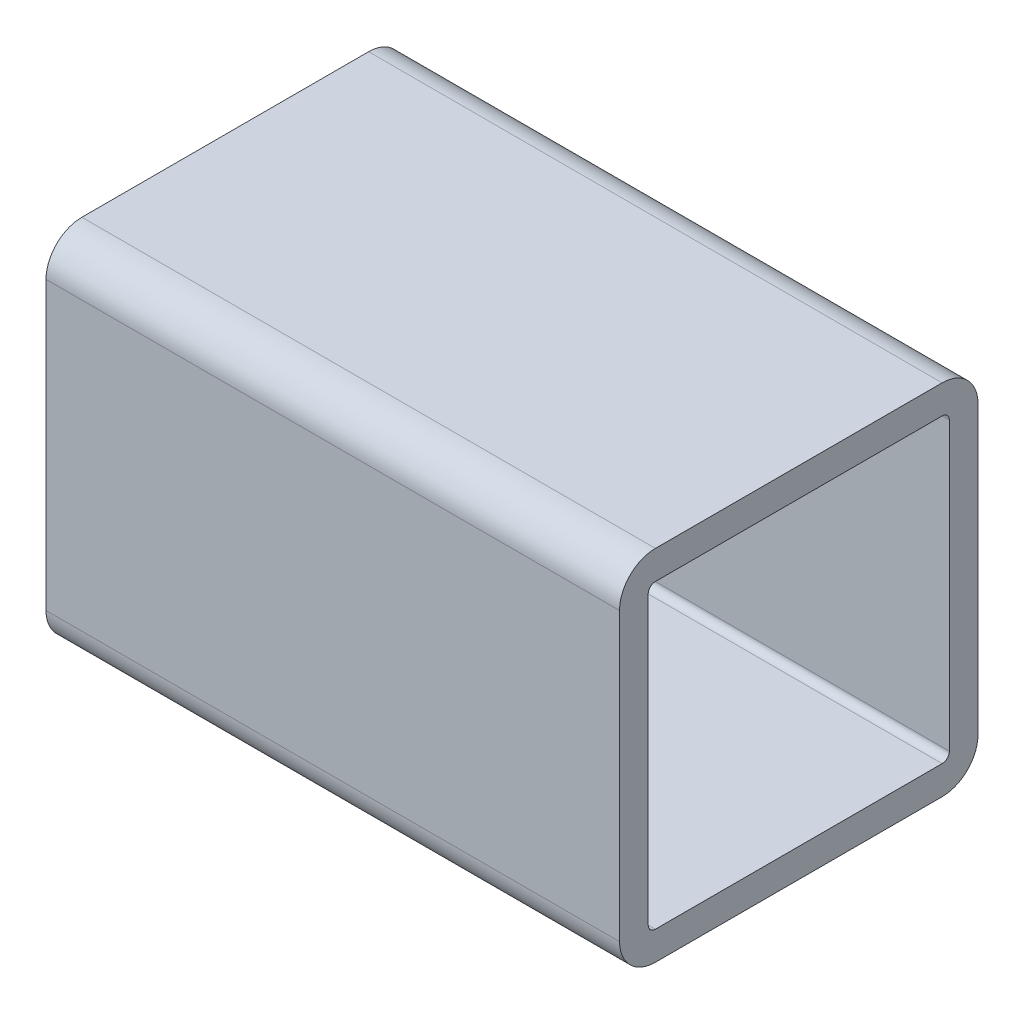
ISO-10303-21;
HEADER;
FILE_DESCRIPTION(('STEP AP214'),'2;1');
FILE_NAME('part.step','',(''),(''),'','','');
FILE_SCHEMA(('AUTOMOTIVE_DESIGN { 1 0 10303 214 1 1 1 1 }'));
ENDSEC;
DATA;
#1=APPLICATION_CONTEXT('core data for automotive mechanical design processes');
#2=APPLICATION_PROTOCOL_DEFINITION('international standard','automotive_design',2000,#1);
#3=PRODUCT_CONTEXT('',#1,'mechanical');
#4=PRODUCT('Part','Part','',(#3));
#5=PRODUCT_RELATED_PRODUCT_CATEGORY('part','',(#4));
#6=PRODUCT_DEFINITION_FORMATION('','',#4);
#7=PRODUCT_DEFINITION_CONTEXT('part definition',#1,'design');
#8=PRODUCT_DEFINITION('design','',#6,#7);
#9=PRODUCT_DEFINITION_SHAPE('','',#8);
#10=(LENGTH_UNIT() NAMED_UNIT(*) SI_UNIT(.MILLI.,.METRE.));
#11=(NAMED_UNIT(*) PLANE_ANGLE_UNIT() SI_UNIT($,.RADIAN.));
#12=(NAMED_UNIT(*) SI_UNIT($,.STERADIAN.) SOLID_ANGLE_UNIT());
#13=UNCERTAINTY_MEASURE_WITH_UNIT(LENGTH_MEASURE(1.E-05),#10,'distance_accuracy_value','');
#14=(GEOMETRIC_REPRESENTATION_CONTEXT(3) GLOBAL_UNCERTAINTY_ASSIGNED_CONTEXT((#13)) GLOBAL_UNIT_ASSIGNED_CONTEXT((#10,
#11,#12)) REPRESENTATION_CONTEXT('',''));
#15=CARTESIAN_POINT('',(0.,0.,0.));
#16=DIRECTION('',(0.,0.,1.));
#17=DIRECTION('',(1.,0.,0.));
#18=AXIS2_PLACEMENT_3D('',#15,#16,#17);
#19=CARTESIAN_POINT('',(40.,-10.,10.));
#20=DIRECTION('',(1.,0.,0.));
#21=DIRECTION('',(0.,0.,-1.));
#22=AXIS2_PLACEMENT_3D('',#19,#20,#21);
#23=PLANE('',#22);
#24=CARTESIAN_POINT('',(40.,-10.,10.));
#25=DIRECTION('',(1.,0.,0.));
#26=DIRECTION('',(0.,0.,-1.));
#27=AXIS2_PLACEMENT_3D('',#24,#25,#26);
#28=CIRCLE('',#27,2.5);
#29=CARTESIAN_POINT('',(40.,-9.99999999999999,12.5));
#30=VERTEX_POINT('',#29);
#31=CARTESIAN_POINT('',(40.,-12.5,9.99999999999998));
#32=VERTEX_POINT('',#31);
#33=EDGE_CURVE('E213',#30,#32,#28,.T.);
#34=ORIENTED_EDGE('',*,*,#33,.T.);
#35=DIRECTION('',(0.,0.,-1.));
#36=VECTOR('',#35,1.);
#37=CARTESIAN_POINT('',(40.,-12.5,9.99999999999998));
#38=LINE('',#37,#36);
#39=CARTESIAN_POINT('',(40.,-12.5,-9.99999999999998));
#40=VERTEX_POINT('',#39);
#41=EDGE_CURVE('E216',#32,#40,#38,.T.);
#42=ORIENTED_EDGE('',*,*,#41,.T.);
#43=CARTESIAN_POINT('',(40.,-10.,-10.));
#44=DIRECTION('',(1.,0.,0.));
#45=DIRECTION('',(0.,0.,-1.));
#46=AXIS2_PLACEMENT_3D('',#43,#44,#45);
#47=CIRCLE('',#46,2.5);
#48=CARTESIAN_POINT('',(40.,-9.99999999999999,-12.5));
#49=VERTEX_POINT('',#48);
#50=EDGE_CURVE('E219',#40,#49,#47,.T.);
#51=ORIENTED_EDGE('',*,*,#50,.T.);
#52=DIRECTION('',(0.,1.,0.));
#53=VECTOR('',#52,1.);
#54=CARTESIAN_POINT('',(40.,9.99999999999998,-12.5));
#55=LINE('',#54,#53);
#56=CARTESIAN_POINT('',(40.,9.99999999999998,-12.5));
#57=VERTEX_POINT('',#56);
#58=EDGE_CURVE('E221',#49,#57,#55,.T.);
#59=ORIENTED_EDGE('',*,*,#58,.T.);
#60=CARTESIAN_POINT('',(40.,10.,-10.));
#61=DIRECTION('',(1.,0.,0.));
#62=DIRECTION('',(0.,0.,1.));
#63=AXIS2_PLACEMENT_3D('',#60,#61,#62);
#64=CIRCLE('',#63,2.5);
#65=CARTESIAN_POINT('',(40.,12.5,-9.99999999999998));
#66=VERTEX_POINT('',#65);
#67=EDGE_CURVE('E223',#57,#66,#64,.T.);
#68=ORIENTED_EDGE('',*,*,#67,.T.);
#69=DIRECTION('',(0.,0.,1.));
#70=VECTOR('',#69,1.);
#71=CARTESIAN_POINT('',(40.,12.5,9.99999999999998));
#72=LINE('',#71,#70);
#73=CARTESIAN_POINT('',(40.,12.5,9.99999999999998));
#74=VERTEX_POINT('',#73);
#75=EDGE_CURVE('E225',#66,#74,#72,.T.);
#76=ORIENTED_EDGE('',*,*,#75,.T.);
#77=CARTESIAN_POINT('',(40.,10.,10.));
#78=DIRECTION('',(1.,0.,0.));
#79=DIRECTION('',(0.,0.,-1.));
#80=AXIS2_PLACEMENT_3D('',#77,#78,#79);
#81=CIRCLE('',#80,2.5);
#82=CARTESIAN_POINT('',(40.,9.99999999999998,12.5));
#83=VERTEX_POINT('',#82);
#84=EDGE_CURVE('E227',#74,#83,#81,.T.);
#85=ORIENTED_EDGE('',*,*,#84,.T.);
#86=DIRECTION('',(0.,-1.,0.));
#87=VECTOR('',#86,1.);
#88=CARTESIAN_POINT('',(40.,9.99999999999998,12.5));
#89=LINE('',#88,#87);
#90=EDGE_CURVE('E229',#83,#30,#89,.T.);
#91=ORIENTED_EDGE('',*,*,#90,.T.);
#92=EDGE_LOOP('',(#34,#42,#51,#59,#68,#76,#85,#91));
#93=FACE_BOUND('',#92,.T.);
#94=DIRECTION('',(0.,-1.,0.));
#95=VECTOR('',#94,1.);
#96=CARTESIAN_POINT('',(40.,9.99999999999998,10.5));
#97=LINE('',#96,#95);
#98=CARTESIAN_POINT('',(40.,9.99999999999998,10.5));
#99=VERTEX_POINT('',#98);
#100=CARTESIAN_POINT('',(40.,-10.,10.5));
#101=VERTEX_POINT('',#100);
#102=EDGE_CURVE('E156',#99,#101,#97,.T.);
#103=ORIENTED_EDGE('',*,*,#102,.F.);
#104=CARTESIAN_POINT('',(40.,10.,10.));
#105=DIRECTION('',(1.,0.,0.));
#106=DIRECTION('',(0.,0.,-1.));
#107=AXIS2_PLACEMENT_3D('',#104,#105,#106);
#108=CIRCLE('',#107,0.5);
#109=CARTESIAN_POINT('',(40.,10.5,9.99999999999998));
#110=VERTEX_POINT('',#109);
#111=EDGE_CURVE('E148',#110,#99,#108,.T.);
#112=ORIENTED_EDGE('',*,*,#111,.F.);
#113=DIRECTION('',(0.,0.,1.));
#114=VECTOR('',#113,1.);
#115=CARTESIAN_POINT('',(40.,10.5,9.99999999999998));
#116=LINE('',#115,#114);
#117=CARTESIAN_POINT('',(40.,10.5,-9.99999999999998));
#118=VERTEX_POINT('',#117);
#119=EDGE_CURVE('E181',#118,#110,#116,.T.);
#120=ORIENTED_EDGE('',*,*,#119,.F.);
#121=CARTESIAN_POINT('',(40.,10.,-10.));
#122=DIRECTION('',(1.,0.,0.));
#123=DIRECTION('',(0.,0.,1.));
#124=AXIS2_PLACEMENT_3D('',#121,#122,#123);
#125=CIRCLE('',#124,0.5);
#126=CARTESIAN_POINT('',(40.,9.99999999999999,-10.5));
#127=VERTEX_POINT('',#126);
#128=EDGE_CURVE('E179',#127,#118,#125,.T.);
#129=ORIENTED_EDGE('',*,*,#128,.F.);
#130=DIRECTION('',(0.,1.,0.));
#131=VECTOR('',#130,1.);
#132=CARTESIAN_POINT('',(40.,9.99999999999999,-10.5));
#133=LINE('',#132,#131);
#134=CARTESIAN_POINT('',(40.,-9.99999999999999,-10.5));
#135=VERTEX_POINT('',#134);
#136=EDGE_CURVE('E177',#135,#127,#133,.T.);
#137=ORIENTED_EDGE('',*,*,#136,.F.);
#138=CARTESIAN_POINT('',(40.,-10.,-10.));
#139=DIRECTION('',(1.,0.,0.));
#140=DIRECTION('',(0.,0.,-1.));
#141=AXIS2_PLACEMENT_3D('',#138,#139,#140);
#142=CIRCLE('',#141,0.499999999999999);
#143=CARTESIAN_POINT('',(40.,-10.5,-10.));
#144=VERTEX_POINT('',#143);
#145=EDGE_CURVE('E175',#144,#135,#142,.T.);
#146=ORIENTED_EDGE('',*,*,#145,.F.);
#147=DIRECTION('',(0.,0.,-1.));
#148=VECTOR('',#147,1.);
#149=CARTESIAN_POINT('',(40.,-10.5,9.99999999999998));
#150=LINE('',#149,#148);
#151=CARTESIAN_POINT('',(40.,-10.5,9.99999999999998));
#152=VERTEX_POINT('',#151);
#153=EDGE_CURVE('E171',#152,#144,#150,.T.);
#154=ORIENTED_EDGE('',*,*,#153,.F.);
#155=CARTESIAN_POINT('',(40.,-10.,10.));
#156=DIRECTION('',(1.,0.,0.));
#157=DIRECTION('',(0.,0.,-1.));
#158=AXIS2_PLACEMENT_3D('',#155,#156,#157);
#159=CIRCLE('',#158,0.5);
#160=EDGE_CURVE('E169',#101,#152,#159,.T.);
#161=ORIENTED_EDGE('',*,*,#160,.F.);
#162=EDGE_LOOP('',(#103,#112,#120,#129,#137,#146,#154,#161));
#163=FACE_BOUND('',#162,.T.);
#164=ADVANCED_FACE('F35',(#93,#163),#23,.T.);
#165=CARTESIAN_POINT('',(0.,-10.,10.));
#166=DIRECTION('',(1.,0.,0.));
#167=DIRECTION('',(0.,0.,-1.));
#168=AXIS2_PLACEMENT_3D('',#165,#166,#167);
#169=PLANE('',#168);
#170=CARTESIAN_POINT('',(0.,-10.,10.));
#171=DIRECTION('',(1.,0.,0.));
#172=DIRECTION('',(0.,0.,-1.));
#173=AXIS2_PLACEMENT_3D('',#170,#171,#172);
#174=CIRCLE('',#173,2.5);
#175=CARTESIAN_POINT('',(0.,-9.99999999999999,12.5));
#176=VERTEX_POINT('',#175);
#177=CARTESIAN_POINT('',(0.,-12.5,9.99999999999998));
#178=VERTEX_POINT('',#177);
#179=EDGE_CURVE('E164',#176,#178,#174,.T.);
#180=ORIENTED_EDGE('',*,*,#179,.F.);
#181=DIRECTION('',(0.,-1.,0.));
#182=VECTOR('',#181,1.);
#183=CARTESIAN_POINT('',(0.,9.99999999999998,12.5));
#184=LINE('',#183,#182);
#185=CARTESIAN_POINT('',(0.,9.99999999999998,12.5));
#186=VERTEX_POINT('',#185);
#187=EDGE_CURVE('E217',#186,#176,#184,.T.);
#188=ORIENTED_EDGE('',*,*,#187,.F.);
#189=CARTESIAN_POINT('',(0.,10.,10.));
#190=DIRECTION('',(1.,0.,0.));
#191=DIRECTION('',(0.,0.,-1.));
#192=AXIS2_PLACEMENT_3D('',#189,#190,#191);
#193=CIRCLE('',#192,2.5);
#194=CARTESIAN_POINT('',(0.,12.5,9.99999999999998));
#195=VERTEX_POINT('',#194);
#196=EDGE_CURVE('E244',#195,#186,#193,.T.);
#197=ORIENTED_EDGE('',*,*,#196,.F.);
#198=DIRECTION('',(0.,0.,1.));
#199=VECTOR('',#198,1.);
#200=CARTESIAN_POINT('',(0.,12.5,9.99999999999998));
#201=LINE('',#200,#199);
#202=CARTESIAN_POINT('',(0.,12.5,-9.99999999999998));
#203=VERTEX_POINT('',#202);
#204=EDGE_CURVE('E242',#203,#195,#201,.T.);
#205=ORIENTED_EDGE('',*,*,#204,.F.);
#206=CARTESIAN_POINT('',(0.,10.,-10.));
#207=DIRECTION('',(1.,0.,0.));
#208=DIRECTION('',(0.,0.,1.));
#209=AXIS2_PLACEMENT_3D('',#206,#207,#208);
#210=CIRCLE('',#209,2.5);
#211=CARTESIAN_POINT('',(0.,9.99999999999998,-12.5));
#212=VERTEX_POINT('',#211);
#213=EDGE_CURVE('E240',#212,#203,#210,.T.);
#214=ORIENTED_EDGE('',*,*,#213,.F.);
#215=DIRECTION('',(0.,1.,0.));
#216=VECTOR('',#215,1.);
#217=CARTESIAN_POINT('',(0.,9.99999999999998,-12.5));
#218=LINE('',#217,#216);
#219=CARTESIAN_POINT('',(0.,-9.99999999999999,-12.5));
#220=VERTEX_POINT('',#219);
#221=EDGE_CURVE('E238',#220,#212,#218,.T.);
#222=ORIENTED_EDGE('',*,*,#221,.F.);
#223=CARTESIAN_POINT('',(0.,-10.,-10.));
#224=DIRECTION('',(1.,0.,0.));
#225=DIRECTION('',(0.,0.,-1.));
#226=AXIS2_PLACEMENT_3D('',#223,#224,#225);
#227=CIRCLE('',#226,2.5);
#228=CARTESIAN_POINT('',(0.,-12.5,-9.99999999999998));
#229=VERTEX_POINT('',#228);
#230=EDGE_CURVE('E236',#229,#220,#227,.T.);
#231=ORIENTED_EDGE('',*,*,#230,.F.);
#232=DIRECTION('',(0.,0.,-1.));
#233=VECTOR('',#232,1.);
#234=CARTESIAN_POINT('',(0.,-12.5,9.99999999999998));
#235=LINE('',#234,#233);
#236=EDGE_CURVE('E234',#178,#229,#235,.T.);
#237=ORIENTED_EDGE('',*,*,#236,.F.);
#238=EDGE_LOOP('',(#180,#188,#197,#205,#214,#222,#231,#237));
#239=FACE_BOUND('',#238,.T.);
#240=CARTESIAN_POINT('',(0.,10.,10.));
#241=DIRECTION('',(1.,0.,0.));
#242=DIRECTION('',(0.,0.,-1.));
#243=AXIS2_PLACEMENT_3D('',#240,#241,#242);
#244=CIRCLE('',#243,0.5);
#245=CARTESIAN_POINT('',(0.,10.5,9.99999999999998));
#246=VERTEX_POINT('',#245);
#247=CARTESIAN_POINT('',(0.,9.99999999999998,10.5));
#248=VERTEX_POINT('',#247);
#249=EDGE_CURVE('E58',#246,#248,#244,.T.);
#250=ORIENTED_EDGE('',*,*,#249,.T.);
#251=DIRECTION('',(0.,-1.,0.));
#252=VECTOR('',#251,1.);
#253=CARTESIAN_POINT('',(0.,9.99999999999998,10.5));
#254=LINE('',#253,#252);
#255=CARTESIAN_POINT('',(0.,-10.,10.5));
#256=VERTEX_POINT('',#255);
#257=EDGE_CURVE('E163',#248,#256,#254,.T.);
#258=ORIENTED_EDGE('',*,*,#257,.T.);
#259=CARTESIAN_POINT('',(0.,-10.,10.));
#260=DIRECTION('',(1.,0.,0.));
#261=DIRECTION('',(0.,0.,-1.));
#262=AXIS2_PLACEMENT_3D('',#259,#260,#261);
#263=CIRCLE('',#262,0.5);
#264=CARTESIAN_POINT('',(0.,-10.5,9.99999999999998));
#265=VERTEX_POINT('',#264);
#266=EDGE_CURVE('E185',#256,#265,#263,.T.);
#267=ORIENTED_EDGE('',*,*,#266,.T.);
#268=DIRECTION('',(0.,0.,-1.));
#269=VECTOR('',#268,1.);
#270=CARTESIAN_POINT('',(0.,-10.5,9.99999999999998));
#271=LINE('',#270,#269);
#272=CARTESIAN_POINT('',(0.,-10.5,-10.));
#273=VERTEX_POINT('',#272);
#274=EDGE_CURVE('E188',#265,#273,#271,.T.);
#275=ORIENTED_EDGE('',*,*,#274,.T.);
#276=CARTESIAN_POINT('',(0.,-10.,-10.));
#277=DIRECTION('',(1.,0.,0.));
#278=DIRECTION('',(0.,0.,-1.));
#279=AXIS2_PLACEMENT_3D('',#276,#277,#278);
#280=CIRCLE('',#279,0.499999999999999);
#281=CARTESIAN_POINT('',(0.,-9.99999999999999,-10.5));
#282=VERTEX_POINT('',#281);
#283=EDGE_CURVE('E191',#273,#282,#280,.T.);
#284=ORIENTED_EDGE('',*,*,#283,.T.);
#285=DIRECTION('',(0.,1.,0.));
#286=VECTOR('',#285,1.);
#287=CARTESIAN_POINT('',(0.,9.99999999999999,-10.5));
#288=LINE('',#287,#286);
#289=CARTESIAN_POINT('',(0.,9.99999999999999,-10.5));
#290=VERTEX_POINT('',#289);
#291=EDGE_CURVE('E194',#282,#290,#288,.T.);
#292=ORIENTED_EDGE('',*,*,#291,.T.);
#293=CARTESIAN_POINT('',(0.,10.,-10.));
#294=DIRECTION('',(1.,0.,0.));
#295=DIRECTION('',(0.,0.,1.));
#296=AXIS2_PLACEMENT_3D('',#293,#294,#295);
#297=CIRCLE('',#296,0.5);
#298=CARTESIAN_POINT('',(0.,10.5,-9.99999999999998));
#299=VERTEX_POINT('',#298);
#300=EDGE_CURVE('E197',#290,#299,#297,.T.);
#301=ORIENTED_EDGE('',*,*,#300,.T.);
#302=DIRECTION('',(0.,0.,1.));
#303=VECTOR('',#302,1.);
#304=CARTESIAN_POINT('',(0.,10.5,9.99999999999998));
#305=LINE('',#304,#303);
#306=EDGE_CURVE('E157',#299,#246,#305,.T.);
#307=ORIENTED_EDGE('',*,*,#306,.T.);
#308=EDGE_LOOP('',(#250,#258,#267,#275,#284,#292,#301,#307));
#309=FACE_BOUND('',#308,.T.);
#310=ADVANCED_FACE('F274',(#239,#309),#169,.F.);
#311=CARTESIAN_POINT('',(40.,-10.,10.));
#312=DIRECTION('',(-1.,0.,0.));
#313=DIRECTION('',(0.,0.,1.));
#314=AXIS2_PLACEMENT_3D('',#311,#312,#313);
#315=CYLINDRICAL_SURFACE('',#314,2.5);
#316=ORIENTED_EDGE('',*,*,#179,.T.);
#317=DIRECTION('',(-1.,0.,0.));
#318=VECTOR('',#317,1.);
#319=CARTESIAN_POINT('',(40.,-12.5,9.99999999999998));
#320=LINE('',#319,#318);
#321=EDGE_CURVE('E11',#32,#178,#320,.T.);
#322=ORIENTED_EDGE('',*,*,#321,.F.);
#323=ORIENTED_EDGE('',*,*,#33,.F.);
#324=DIRECTION('',(-1.,0.,0.));
#325=VECTOR('',#324,1.);
#326=CARTESIAN_POINT('',(40.,-9.99999999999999,12.5));
#327=LINE('',#326,#325);
#328=EDGE_CURVE('E231',#30,#176,#327,.T.);
#329=ORIENTED_EDGE('',*,*,#328,.T.);
#330=EDGE_LOOP('',(#316,#322,#323,#329));
#331=FACE_BOUND('',#330,.T.);
#332=ADVANCED_FACE('F37',(#331),#315,.T.);
#333=CARTESIAN_POINT('',(40.,-12.5,9.99999999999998));
#334=DIRECTION('',(0.,1.,0.));
#335=DIRECTION('',(0.,0.,1.));
#336=AXIS2_PLACEMENT_3D('',#333,#334,#335);
#337=PLANE('',#336);
#338=ORIENTED_EDGE('',*,*,#236,.T.);
#339=DIRECTION('',(-1.,0.,0.));
#340=VECTOR('',#339,1.);
#341=CARTESIAN_POINT('',(40.,-12.5,-9.99999999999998));
#342=LINE('',#341,#340);
#343=EDGE_CURVE('E43',#40,#229,#342,.T.);
#344=ORIENTED_EDGE('',*,*,#343,.F.);
#345=ORIENTED_EDGE('',*,*,#41,.F.);
#346=ORIENTED_EDGE('',*,*,#321,.T.);
#347=EDGE_LOOP('',(#338,#344,#345,#346));
#348=FACE_BOUND('',#347,.T.);
#349=ADVANCED_FACE('F291',(#348),#337,.F.);
#350=CARTESIAN_POINT('',(40.,-10.,-10.));
#351=DIRECTION('',(-1.,0.,0.));
#352=DIRECTION('',(0.,0.,1.));
#353=AXIS2_PLACEMENT_3D('',#350,#351,#352);
#354=CYLINDRICAL_SURFACE('',#353,2.5);
#355=ORIENTED_EDGE('',*,*,#230,.T.);
#356=DIRECTION('',(-1.,0.,0.));
#357=VECTOR('',#356,1.);
#358=CARTESIAN_POINT('',(40.,-9.99999999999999,-12.5));
#359=LINE('',#358,#357);
#360=EDGE_CURVE('E261',#49,#220,#359,.T.);
#361=ORIENTED_EDGE('',*,*,#360,.F.);
#362=ORIENTED_EDGE('',*,*,#50,.F.);
#363=ORIENTED_EDGE('',*,*,#343,.T.);
#364=EDGE_LOOP('',(#355,#361,#362,#363));
#365=FACE_BOUND('',#364,.T.);
#366=ADVANCED_FACE('F268',(#365),#354,.T.);
#367=CARTESIAN_POINT('',(40.,9.99999999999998,-12.5));
#368=DIRECTION('',(0.,0.,1.));
#369=DIRECTION('',(0.,-1.,0.));
#370=AXIS2_PLACEMENT_3D('',#367,#368,#369);
#371=PLANE('',#370);
#372=ORIENTED_EDGE('',*,*,#221,.T.);
#373=DIRECTION('',(-1.,0.,0.));
#374=VECTOR('',#373,1.);
#375=CARTESIAN_POINT('',(40.,9.99999999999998,-12.5));
#376=LINE('',#375,#374);
#377=EDGE_CURVE('E258',#57,#212,#376,.T.);
#378=ORIENTED_EDGE('',*,*,#377,.F.);
#379=ORIENTED_EDGE('',*,*,#58,.F.);
#380=ORIENTED_EDGE('',*,*,#360,.T.);
#381=EDGE_LOOP('',(#372,#378,#379,#380));
#382=FACE_BOUND('',#381,.T.);
#383=ADVANCED_FACE('F280',(#382),#371,.F.);
#384=CARTESIAN_POINT('',(40.,10.,-10.));
#385=DIRECTION('',(-1.,0.,0.));
#386=DIRECTION('',(0.,0.,1.));
#387=AXIS2_PLACEMENT_3D('',#384,#385,#386);
#388=CYLINDRICAL_SURFACE('',#387,2.5);
#389=ORIENTED_EDGE('',*,*,#213,.T.);
#390=DIRECTION('',(-1.,0.,0.));
#391=VECTOR('',#390,1.);
#392=CARTESIAN_POINT('',(40.,12.5,-9.99999999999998));
#393=LINE('',#392,#391);
#394=EDGE_CURVE('E255',#66,#203,#393,.T.);
#395=ORIENTED_EDGE('',*,*,#394,.F.);
#396=ORIENTED_EDGE('',*,*,#67,.F.);
#397=ORIENTED_EDGE('',*,*,#377,.T.);
#398=EDGE_LOOP('',(#389,#395,#396,#397));
#399=FACE_BOUND('',#398,.T.);
#400=ADVANCED_FACE('F284',(#399),#388,.T.);
#401=CARTESIAN_POINT('',(40.,12.5,9.99999999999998));
#402=DIRECTION('',(0.,-1.,0.));
#403=DIRECTION('',(0.,0.,-1.));
#404=AXIS2_PLACEMENT_3D('',#401,#402,#403);
#405=PLANE('',#404);
#406=ORIENTED_EDGE('',*,*,#204,.T.);
#407=DIRECTION('',(-1.,0.,0.));
#408=VECTOR('',#407,1.);
#409=CARTESIAN_POINT('',(40.,12.5,9.99999999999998));
#410=LINE('',#409,#408);
#411=EDGE_CURVE('E252',#74,#195,#410,.T.);
#412=ORIENTED_EDGE('',*,*,#411,.F.);
#413=ORIENTED_EDGE('',*,*,#75,.F.);
#414=ORIENTED_EDGE('',*,*,#394,.T.);
#415=EDGE_LOOP('',(#406,#412,#413,#414));
#416=FACE_BOUND('',#415,.T.);
#417=ADVANCED_FACE('F304',(#416),#405,.F.);
#418=CARTESIAN_POINT('',(40.,10.,10.));
#419=DIRECTION('',(-1.,0.,0.));
#420=DIRECTION('',(0.,0.,1.));
#421=AXIS2_PLACEMENT_3D('',#418,#419,#420);
#422=CYLINDRICAL_SURFACE('',#421,2.5);
#423=ORIENTED_EDGE('',*,*,#196,.T.);
#424=DIRECTION('',(-1.,0.,0.));
#425=VECTOR('',#424,1.);
#426=CARTESIAN_POINT('',(40.,9.99999999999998,12.5));
#427=LINE('',#426,#425);
#428=EDGE_CURVE('E249',#83,#186,#427,.T.);
#429=ORIENTED_EDGE('',*,*,#428,.F.);
#430=ORIENTED_EDGE('',*,*,#84,.F.);
#431=ORIENTED_EDGE('',*,*,#411,.T.);
#432=EDGE_LOOP('',(#423,#429,#430,#431));
#433=FACE_BOUND('',#432,.T.);
#434=ADVANCED_FACE('F302',(#433),#422,.T.);
#435=CARTESIAN_POINT('',(40.,9.99999999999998,12.5));
#436=DIRECTION('',(0.,0.,-1.));
#437=DIRECTION('',(0.,1.,0.));
#438=AXIS2_PLACEMENT_3D('',#435,#436,#437);
#439=PLANE('',#438);
#440=ORIENTED_EDGE('',*,*,#187,.T.);
#441=ORIENTED_EDGE('',*,*,#328,.F.);
#442=ORIENTED_EDGE('',*,*,#90,.F.);
#443=ORIENTED_EDGE('',*,*,#428,.T.);
#444=EDGE_LOOP('',(#440,#441,#442,#443));
#445=FACE_BOUND('',#444,.T.);
#446=ADVANCED_FACE('F297',(#445),#439,.F.);
#447=CARTESIAN_POINT('',(40.,10.,10.));
#448=DIRECTION('',(-1.,0.,0.));
#449=DIRECTION('',(0.,0.,1.));
#450=AXIS2_PLACEMENT_3D('',#447,#448,#449);
#451=CYLINDRICAL_SURFACE('',#450,0.5);
#452=ORIENTED_EDGE('',*,*,#249,.F.);
#453=DIRECTION('',(-1.,0.,0.));
#454=VECTOR('',#453,1.);
#455=CARTESIAN_POINT('',(40.,10.5,9.99999999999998));
#456=LINE('',#455,#454);
#457=EDGE_CURVE('E152',#110,#246,#456,.T.);
#458=ORIENTED_EDGE('',*,*,#457,.F.);
#459=ORIENTED_EDGE('',*,*,#111,.T.);
#460=DIRECTION('',(-1.,0.,0.));
#461=VECTOR('',#460,1.);
#462=CARTESIAN_POINT('',(40.,9.99999999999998,10.5));
#463=LINE('',#462,#461);
#464=EDGE_CURVE('E151',#99,#248,#463,.T.);
#465=ORIENTED_EDGE('',*,*,#464,.T.);
#466=EDGE_LOOP('',(#452,#458,#459,#465));
#467=FACE_BOUND('',#466,.T.);
#468=ADVANCED_FACE('F150',(#467),#451,.F.);
#469=CARTESIAN_POINT('',(40.,9.99999999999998,10.5));
#470=DIRECTION('',(0.,0.,-1.));
#471=DIRECTION('',(0.,1.,0.));
#472=AXIS2_PLACEMENT_3D('',#469,#470,#471);
#473=PLANE('',#472);
#474=ORIENTED_EDGE('',*,*,#257,.F.);
#475=ORIENTED_EDGE('',*,*,#464,.F.);
#476=ORIENTED_EDGE('',*,*,#102,.T.);
#477=DIRECTION('',(-1.,0.,0.));
#478=VECTOR('',#477,1.);
#479=CARTESIAN_POINT('',(40.,-10.,10.5));
#480=LINE('',#479,#478);
#481=EDGE_CURVE('E165',#101,#256,#480,.T.);
#482=ORIENTED_EDGE('',*,*,#481,.T.);
#483=EDGE_LOOP('',(#474,#475,#476,#482));
#484=FACE_BOUND('',#483,.T.);
#485=ADVANCED_FACE('F160',(#484),#473,.T.);
#486=CARTESIAN_POINT('',(40.,-10.,10.));
#487=DIRECTION('',(-1.,0.,0.));
#488=DIRECTION('',(0.,0.,1.));
#489=AXIS2_PLACEMENT_3D('',#486,#487,#488);
#490=CYLINDRICAL_SURFACE('',#489,0.5);
#491=ORIENTED_EDGE('',*,*,#266,.F.);
#492=ORIENTED_EDGE('',*,*,#481,.F.);
#493=ORIENTED_EDGE('',*,*,#160,.T.);
#494=DIRECTION('',(-1.,0.,0.));
#495=VECTOR('',#494,1.);
#496=CARTESIAN_POINT('',(40.,-10.5,9.99999999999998));
#497=LINE('',#496,#495);
#498=EDGE_CURVE('E210',#152,#265,#497,.T.);
#499=ORIENTED_EDGE('',*,*,#498,.T.);
#500=EDGE_LOOP('',(#491,#492,#493,#499));
#501=FACE_BOUND('',#500,.T.);
#502=ADVANCED_FACE('F329',(#501),#490,.F.);
#503=CARTESIAN_POINT('',(40.,-10.5,9.99999999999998));
#504=DIRECTION('',(0.,1.,0.));
#505=DIRECTION('',(0.,0.,1.));
#506=AXIS2_PLACEMENT_3D('',#503,#504,#505);
#507=PLANE('',#506);
#508=ORIENTED_EDGE('',*,*,#274,.F.);
#509=ORIENTED_EDGE('',*,*,#498,.F.);
#510=ORIENTED_EDGE('',*,*,#153,.T.);
#511=DIRECTION('',(-1.,0.,0.));
#512=VECTOR('',#511,1.);
#513=CARTESIAN_POINT('',(40.,-10.5,-10.));
#514=LINE('',#513,#512);
#515=EDGE_CURVE('E208',#144,#273,#514,.T.);
#516=ORIENTED_EDGE('',*,*,#515,.T.);
#517=EDGE_LOOP('',(#508,#509,#510,#516));
#518=FACE_BOUND('',#517,.T.);
#519=ADVANCED_FACE('F333',(#518),#507,.T.);
#520=CARTESIAN_POINT('',(40.,-10.,-10.));
#521=DIRECTION('',(-1.,0.,0.));
#522=DIRECTION('',(0.,0.,1.));
#523=AXIS2_PLACEMENT_3D('',#520,#521,#522);
#524=CYLINDRICAL_SURFACE('',#523,0.499999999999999);
#525=ORIENTED_EDGE('',*,*,#283,.F.);
#526=ORIENTED_EDGE('',*,*,#515,.F.);
#527=ORIENTED_EDGE('',*,*,#145,.T.);
#528=DIRECTION('',(-1.,0.,0.));
#529=VECTOR('',#528,1.);
#530=CARTESIAN_POINT('',(40.,-9.99999999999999,-10.5));
#531=LINE('',#530,#529);
#532=EDGE_CURVE('E206',#135,#282,#531,.T.);
#533=ORIENTED_EDGE('',*,*,#532,.T.);
#534=EDGE_LOOP('',(#525,#526,#527,#533));
#535=FACE_BOUND('',#534,.T.);
#536=ADVANCED_FACE('F339',(#535),#524,.F.);
#537=CARTESIAN_POINT('',(40.,9.99999999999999,-10.5));
#538=DIRECTION('',(0.,0.,1.));
#539=DIRECTION('',(0.,-1.,0.));
#540=AXIS2_PLACEMENT_3D('',#537,#538,#539);
#541=PLANE('',#540);
#542=ORIENTED_EDGE('',*,*,#291,.F.);
#543=ORIENTED_EDGE('',*,*,#532,.F.);
#544=ORIENTED_EDGE('',*,*,#136,.T.);
#545=DIRECTION('',(-1.,0.,0.));
#546=VECTOR('',#545,1.);
#547=CARTESIAN_POINT('',(40.,9.99999999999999,-10.5));
#548=LINE('',#547,#546);
#549=EDGE_CURVE('E204',#127,#290,#548,.T.);
#550=ORIENTED_EDGE('',*,*,#549,.T.);
#551=EDGE_LOOP('',(#542,#543,#544,#550));
#552=FACE_BOUND('',#551,.T.);
#553=ADVANCED_FACE('F343',(#552),#541,.T.);
#554=CARTESIAN_POINT('',(40.,10.,-10.));
#555=DIRECTION('',(-1.,0.,0.));
#556=DIRECTION('',(0.,0.,1.));
#557=AXIS2_PLACEMENT_3D('',#554,#555,#556);
#558=CYLINDRICAL_SURFACE('',#557,0.5);
#559=ORIENTED_EDGE('',*,*,#300,.F.);
#560=ORIENTED_EDGE('',*,*,#549,.F.);
#561=ORIENTED_EDGE('',*,*,#128,.T.);
#562=DIRECTION('',(-1.,0.,0.));
#563=VECTOR('',#562,1.);
#564=CARTESIAN_POINT('',(40.,10.5,-9.99999999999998));
#565=LINE('',#564,#563);
#566=EDGE_CURVE('E50',#118,#299,#565,.T.);
#567=ORIENTED_EDGE('',*,*,#566,.T.);
#568=EDGE_LOOP('',(#559,#560,#561,#567));
#569=FACE_BOUND('',#568,.T.);
#570=ADVANCED_FACE('F347',(#569),#558,.F.);
#571=CARTESIAN_POINT('',(40.,10.5,9.99999999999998));
#572=DIRECTION('',(0.,-1.,0.));
#573=DIRECTION('',(0.,0.,-1.));
#574=AXIS2_PLACEMENT_3D('',#571,#572,#573);
#575=PLANE('',#574);
#576=ORIENTED_EDGE('',*,*,#306,.F.);
#577=ORIENTED_EDGE('',*,*,#566,.F.);
#578=ORIENTED_EDGE('',*,*,#119,.T.);
#579=ORIENTED_EDGE('',*,*,#457,.T.);
#580=EDGE_LOOP('',(#576,#577,#578,#579));
#581=FACE_BOUND('',#580,.T.);
#582=ADVANCED_FACE('F351',(#581),#575,.T.);
#583=CLOSED_SHELL('',(#164,#310,#332,#349,#366,#383,#400,#417,#434,#446,#468,#485,#502,#519,
#536,#553,#570,#582));
#584=MANIFOLD_SOLID_BREP('B2',#583);
#585=ADVANCED_BREP_SHAPE_REPRESENTATION('',(#18,#584),#14);
#586=SHAPE_DEFINITION_REPRESENTATION(#9,#585);
ENDSEC;
END-ISO-10303-21;
